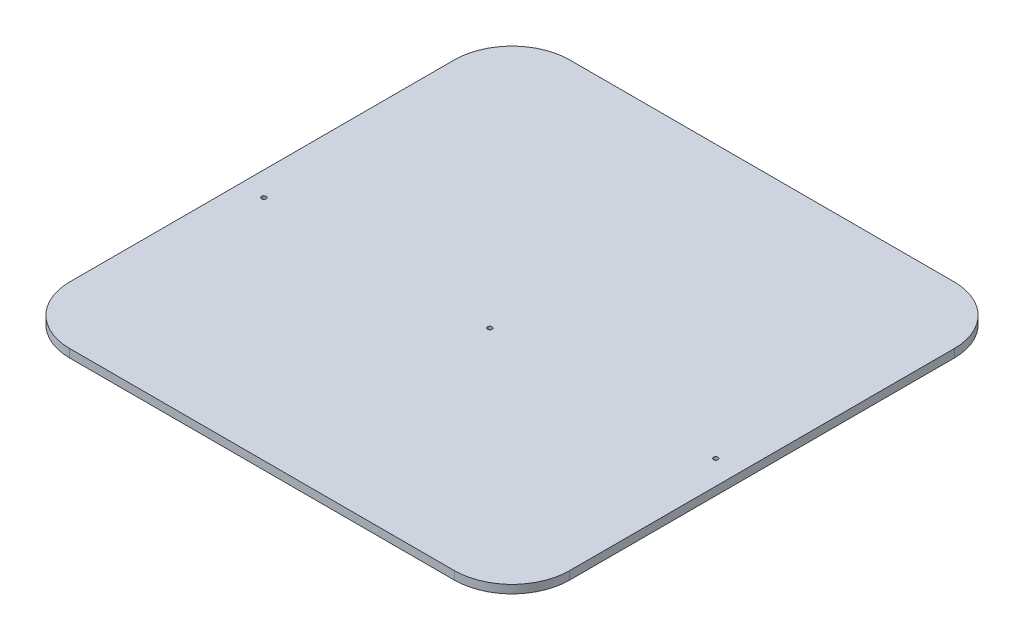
ISO-10303-21;
HEADER;
FILE_DESCRIPTION(('STEP AP214'),'2;1');
FILE_NAME('part.step','',(''),(''),'','','');
FILE_SCHEMA(('AUTOMOTIVE_DESIGN { 1 0 10303 214 1 1 1 1 }'));
ENDSEC;
DATA;
#1=APPLICATION_CONTEXT('core data for automotive mechanical design processes');
#2=APPLICATION_PROTOCOL_DEFINITION('international standard','automotive_design',2000,#1);
#3=PRODUCT_CONTEXT('',#1,'mechanical');
#4=PRODUCT('Part','Part','',(#3));
#5=PRODUCT_RELATED_PRODUCT_CATEGORY('part','',(#4));
#6=PRODUCT_DEFINITION_FORMATION('','',#4);
#7=PRODUCT_DEFINITION_CONTEXT('part definition',#1,'design');
#8=PRODUCT_DEFINITION('design','',#6,#7);
#9=PRODUCT_DEFINITION_SHAPE('','',#8);
#10=(LENGTH_UNIT() NAMED_UNIT(*) SI_UNIT(.MILLI.,.METRE.));
#11=(NAMED_UNIT(*) PLANE_ANGLE_UNIT() SI_UNIT($,.RADIAN.));
#12=(NAMED_UNIT(*) SI_UNIT($,.STERADIAN.) SOLID_ANGLE_UNIT());
#13=UNCERTAINTY_MEASURE_WITH_UNIT(LENGTH_MEASURE(1.E-05),#10,'distance_accuracy_value','');
#14=(GEOMETRIC_REPRESENTATION_CONTEXT(3) GLOBAL_UNCERTAINTY_ASSIGNED_CONTEXT((#13)) GLOBAL_UNIT_ASSIGNED_CONTEXT((#10,
#11,#12)) REPRESENTATION_CONTEXT('',''));
#15=CARTESIAN_POINT('',(0.,0.,0.));
#16=DIRECTION('',(0.,0.,1.));
#17=DIRECTION('',(1.,0.,0.));
#18=AXIS2_PLACEMENT_3D('',#15,#16,#17);
#19=CARTESIAN_POINT('',(203.2,8.73125000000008,-203.2));
#20=DIRECTION('',(0.,-1.,0.));
#21=DIRECTION('',(0.,0.,-1.));
#22=AXIS2_PLACEMENT_3D('',#19,#20,#21);
#23=CYLINDRICAL_SURFACE('',#22,60.96);
#24=CARTESIAN_POINT('',(203.2,0.,-203.2));
#25=DIRECTION('',(0.,1.,0.));
#26=DIRECTION('',(0.,0.,-1.));
#27=AXIS2_PLACEMENT_3D('',#24,#25,#26);
#28=CIRCLE('',#27,60.96);
#29=CARTESIAN_POINT('',(264.16,0.,-203.2));
#30=VERTEX_POINT('',#29);
#31=CARTESIAN_POINT('',(203.2,0.,-264.16));
#32=VERTEX_POINT('',#31);
#33=EDGE_CURVE('E131',#30,#32,#28,.T.);
#34=ORIENTED_EDGE('',*,*,#33,.T.);
#35=DIRECTION('',(0.,-1.,0.));
#36=VECTOR('',#35,1.);
#37=CARTESIAN_POINT('',(203.2,8.73124999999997,-264.16));
#38=LINE('',#37,#36);
#39=CARTESIAN_POINT('',(203.2,8.73124999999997,-264.16));
#40=VERTEX_POINT('',#39);
#41=EDGE_CURVE('E11',#40,#32,#38,.T.);
#42=ORIENTED_EDGE('',*,*,#41,.F.);
#43=CARTESIAN_POINT('',(203.2,8.73125000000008,-203.2));
#44=DIRECTION('',(0.,1.,0.));
#45=DIRECTION('',(0.,0.,-1.));
#46=AXIS2_PLACEMENT_3D('',#43,#44,#45);
#47=CIRCLE('',#46,60.96);
#48=CARTESIAN_POINT('',(264.16,8.73125000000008,-203.2));
#49=VERTEX_POINT('',#48);
#50=EDGE_CURVE('E146',#49,#40,#47,.T.);
#51=ORIENTED_EDGE('',*,*,#50,.F.);
#52=DIRECTION('',(0.,-1.,0.));
#53=VECTOR('',#52,1.);
#54=CARTESIAN_POINT('',(264.16,8.73125000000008,-203.2));
#55=LINE('',#54,#53);
#56=EDGE_CURVE('E127',#49,#30,#55,.T.);
#57=ORIENTED_EDGE('',*,*,#56,.T.);
#58=EDGE_LOOP('',(#34,#42,#51,#57));
#59=FACE_BOUND('',#58,.T.);
#60=ADVANCED_FACE('F35',(#59),#23,.T.);
#61=CARTESIAN_POINT('',(-203.2,8.73124999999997,-264.16));
#62=DIRECTION('',(0.,0.,1.));
#63=DIRECTION('',(1.,0.,0.));
#64=AXIS2_PLACEMENT_3D('',#61,#62,#63);
#65=PLANE('',#64);
#66=DIRECTION('',(-1.,0.,0.));
#67=VECTOR('',#66,1.);
#68=CARTESIAN_POINT('',(-203.2,0.,-264.16));
#69=LINE('',#68,#67);
#70=CARTESIAN_POINT('',(-203.2,0.,-264.16));
#71=VERTEX_POINT('',#70);
#72=EDGE_CURVE('E134',#32,#71,#69,.T.);
#73=ORIENTED_EDGE('',*,*,#72,.T.);
#74=DIRECTION('',(0.,-1.,0.));
#75=VECTOR('',#74,1.);
#76=CARTESIAN_POINT('',(-203.2,8.73124999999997,-264.16));
#77=LINE('',#76,#75);
#78=CARTESIAN_POINT('',(-203.2,8.73124999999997,-264.16));
#79=VERTEX_POINT('',#78);
#80=EDGE_CURVE('E43',#79,#71,#77,.T.);
#81=ORIENTED_EDGE('',*,*,#80,.F.);
#82=DIRECTION('',(-1.,0.,0.));
#83=VECTOR('',#82,1.);
#84=CARTESIAN_POINT('',(-203.2,8.73124999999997,-264.16));
#85=LINE('',#84,#83);
#86=EDGE_CURVE('E94',#40,#79,#85,.T.);
#87=ORIENTED_EDGE('',*,*,#86,.F.);
#88=ORIENTED_EDGE('',*,*,#41,.T.);
#89=EDGE_LOOP('',(#73,#81,#87,#88));
#90=FACE_BOUND('',#89,.T.);
#91=ADVANCED_FACE('F227',(#90),#65,.F.);
#92=CARTESIAN_POINT('',(-203.2,8.73125000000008,-203.2));
#93=DIRECTION('',(0.,-1.,0.));
#94=DIRECTION('',(0.,0.,-1.));
#95=AXIS2_PLACEMENT_3D('',#92,#93,#94);
#96=CYLINDRICAL_SURFACE('',#95,60.96);
#97=CARTESIAN_POINT('',(-203.2,0.,-203.2));
#98=DIRECTION('',(0.,1.,0.));
#99=DIRECTION('',(0.,0.,1.));
#100=AXIS2_PLACEMENT_3D('',#97,#98,#99);
#101=CIRCLE('',#100,60.96);
#102=CARTESIAN_POINT('',(-264.16,0.,-203.2));
#103=VERTEX_POINT('',#102);
#104=EDGE_CURVE('E137',#71,#103,#101,.T.);
#105=ORIENTED_EDGE('',*,*,#104,.T.);
#106=DIRECTION('',(0.,-1.,0.));
#107=VECTOR('',#106,1.);
#108=CARTESIAN_POINT('',(-264.16,8.73124999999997,-203.2));
#109=LINE('',#108,#107);
#110=CARTESIAN_POINT('',(-264.16,8.73124999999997,-203.2));
#111=VERTEX_POINT('',#110);
#112=EDGE_CURVE('E153',#111,#103,#109,.T.);
#113=ORIENTED_EDGE('',*,*,#112,.F.);
#114=CARTESIAN_POINT('',(-203.2,8.73125000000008,-203.2));
#115=DIRECTION('',(0.,1.,0.));
#116=DIRECTION('',(0.,0.,1.));
#117=AXIS2_PLACEMENT_3D('',#114,#115,#116);
#118=CIRCLE('',#117,60.96);
#119=EDGE_CURVE('E161',#79,#111,#118,.T.);
#120=ORIENTED_EDGE('',*,*,#119,.F.);
#121=ORIENTED_EDGE('',*,*,#80,.T.);
#122=EDGE_LOOP('',(#105,#113,#120,#121));
#123=FACE_BOUND('',#122,.T.);
#124=ADVANCED_FACE('F159',(#123),#96,.T.);
#125=CARTESIAN_POINT('',(-264.16,8.73124999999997,-203.2));
#126=DIRECTION('',(1.,0.,0.));
#127=DIRECTION('',(0.,0.,-1.));
#128=AXIS2_PLACEMENT_3D('',#125,#126,#127);
#129=PLANE('',#128);
#130=DIRECTION('',(0.,0.,1.));
#131=VECTOR('',#130,1.);
#132=CARTESIAN_POINT('',(-264.16,0.,-203.2));
#133=LINE('',#132,#131);
#134=CARTESIAN_POINT('',(-264.16,0.,203.2));
#135=VERTEX_POINT('',#134);
#136=EDGE_CURVE('E139',#103,#135,#133,.T.);
#137=ORIENTED_EDGE('',*,*,#136,.T.);
#138=DIRECTION('',(0.,-1.,0.));
#139=VECTOR('',#138,1.);
#140=CARTESIAN_POINT('',(-264.16,8.73124999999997,203.2));
#141=LINE('',#140,#139);
#142=CARTESIAN_POINT('',(-264.16,8.73124999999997,203.2));
#143=VERTEX_POINT('',#142);
#144=EDGE_CURVE('E150',#143,#135,#141,.T.);
#145=ORIENTED_EDGE('',*,*,#144,.F.);
#146=DIRECTION('',(0.,0.,1.));
#147=VECTOR('',#146,1.);
#148=CARTESIAN_POINT('',(-264.16,8.73124999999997,-203.2));
#149=LINE('',#148,#147);
#150=EDGE_CURVE('E173',#111,#143,#149,.T.);
#151=ORIENTED_EDGE('',*,*,#150,.F.);
#152=ORIENTED_EDGE('',*,*,#112,.T.);
#153=EDGE_LOOP('',(#137,#145,#151,#152));
#154=FACE_BOUND('',#153,.T.);
#155=ADVANCED_FACE('F169',(#154),#129,.F.);
#156=CARTESIAN_POINT('',(-203.2,8.73124999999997,203.2));
#157=DIRECTION('',(0.,-1.,0.));
#158=DIRECTION('',(0.,0.,-1.));
#159=AXIS2_PLACEMENT_3D('',#156,#157,#158);
#160=CYLINDRICAL_SURFACE('',#159,60.96);
#161=CARTESIAN_POINT('',(-203.2,0.,203.2));
#162=DIRECTION('',(0.,1.,0.));
#163=DIRECTION('',(0.,0.,1.));
#164=AXIS2_PLACEMENT_3D('',#161,#162,#163);
#165=CIRCLE('',#164,60.96);
#166=CARTESIAN_POINT('',(-203.2,0.,264.16));
#167=VERTEX_POINT('',#166);
#168=EDGE_CURVE('E141',#135,#167,#165,.T.);
#169=ORIENTED_EDGE('',*,*,#168,.T.);
#170=DIRECTION('',(0.,-1.,0.));
#171=VECTOR('',#170,1.);
#172=CARTESIAN_POINT('',(-203.2,8.73124999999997,264.16));
#173=LINE('',#172,#171);
#174=CARTESIAN_POINT('',(-203.2,8.73124999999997,264.16));
#175=VERTEX_POINT('',#174);
#176=EDGE_CURVE('E122',#175,#167,#173,.T.);
#177=ORIENTED_EDGE('',*,*,#176,.F.);
#178=CARTESIAN_POINT('',(-203.2,8.73124999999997,203.2));
#179=DIRECTION('',(0.,1.,0.));
#180=DIRECTION('',(0.,0.,1.));
#181=AXIS2_PLACEMENT_3D('',#178,#179,#180);
#182=CIRCLE('',#181,60.96);
#183=EDGE_CURVE('E113',#143,#175,#182,.T.);
#184=ORIENTED_EDGE('',*,*,#183,.F.);
#185=ORIENTED_EDGE('',*,*,#144,.T.);
#186=EDGE_LOOP('',(#169,#177,#184,#185));
#187=FACE_BOUND('',#186,.T.);
#188=ADVANCED_FACE('F172',(#187),#160,.T.);
#189=CARTESIAN_POINT('',(-203.2,8.73124999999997,264.16));
#190=DIRECTION('',(0.,0.,-1.));
#191=DIRECTION('',(-1.,0.,0.));
#192=AXIS2_PLACEMENT_3D('',#189,#190,#191);
#193=PLANE('',#192);
#194=DIRECTION('',(1.,0.,0.));
#195=VECTOR('',#194,1.);
#196=CARTESIAN_POINT('',(-203.2,0.,264.16));
#197=LINE('',#196,#195);
#198=CARTESIAN_POINT('',(203.2,0.,264.16));
#199=VERTEX_POINT('',#198);
#200=EDGE_CURVE('E121',#167,#199,#197,.T.);
#201=ORIENTED_EDGE('',*,*,#200,.T.);
#202=DIRECTION('',(0.,-1.,0.));
#203=VECTOR('',#202,1.);
#204=CARTESIAN_POINT('',(203.2,8.73124999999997,264.16));
#205=LINE('',#204,#203);
#206=CARTESIAN_POINT('',(203.2,8.73124999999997,264.16));
#207=VERTEX_POINT('',#206);
#208=EDGE_CURVE('E118',#207,#199,#205,.T.);
#209=ORIENTED_EDGE('',*,*,#208,.F.);
#210=DIRECTION('',(1.,0.,0.));
#211=VECTOR('',#210,1.);
#212=CARTESIAN_POINT('',(-203.2,8.73124999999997,264.16));
#213=LINE('',#212,#211);
#214=EDGE_CURVE('E107',#175,#207,#213,.T.);
#215=ORIENTED_EDGE('',*,*,#214,.F.);
#216=ORIENTED_EDGE('',*,*,#176,.T.);
#217=EDGE_LOOP('',(#201,#209,#215,#216));
#218=FACE_BOUND('',#217,.T.);
#219=ADVANCED_FACE('F119',(#218),#193,.F.);
#220=CARTESIAN_POINT('',(203.2,8.73124999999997,203.2));
#221=DIRECTION('',(0.,-1.,0.));
#222=DIRECTION('',(0.,0.,-1.));
#223=AXIS2_PLACEMENT_3D('',#220,#221,#222);
#224=CYLINDRICAL_SURFACE('',#223,60.96);
#225=CARTESIAN_POINT('',(203.2,0.,203.2));
#226=DIRECTION('',(0.,1.,0.));
#227=DIRECTION('',(0.,0.,1.));
#228=AXIS2_PLACEMENT_3D('',#225,#226,#227);
#229=CIRCLE('',#228,60.96);
#230=CARTESIAN_POINT('',(264.16,0.,203.2));
#231=VERTEX_POINT('',#230);
#232=EDGE_CURVE('E80',#199,#231,#229,.T.);
#233=ORIENTED_EDGE('',*,*,#232,.T.);
#234=DIRECTION('',(0.,-1.,0.));
#235=VECTOR('',#234,1.);
#236=CARTESIAN_POINT('',(264.16,8.73124999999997,203.2));
#237=LINE('',#236,#235);
#238=CARTESIAN_POINT('',(264.16,8.73124999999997,203.2));
#239=VERTEX_POINT('',#238);
#240=EDGE_CURVE('E123',#239,#231,#237,.T.);
#241=ORIENTED_EDGE('',*,*,#240,.F.);
#242=CARTESIAN_POINT('',(203.2,8.73124999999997,203.2));
#243=DIRECTION('',(0.,1.,0.));
#244=DIRECTION('',(0.,0.,1.));
#245=AXIS2_PLACEMENT_3D('',#242,#243,#244);
#246=CIRCLE('',#245,60.96);
#247=EDGE_CURVE('E111',#207,#239,#246,.T.);
#248=ORIENTED_EDGE('',*,*,#247,.F.);
#249=ORIENTED_EDGE('',*,*,#208,.T.);
#250=EDGE_LOOP('',(#233,#241,#248,#249));
#251=FACE_BOUND('',#250,.T.);
#252=ADVANCED_FACE('F125',(#251),#224,.T.);
#253=CARTESIAN_POINT('',(264.16,8.73125000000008,-203.2));
#254=DIRECTION('',(-1.,0.,0.));
#255=DIRECTION('',(0.,0.,1.));
#256=AXIS2_PLACEMENT_3D('',#253,#254,#255);
#257=PLANE('',#256);
#258=DIRECTION('',(0.,0.,-1.));
#259=VECTOR('',#258,1.);
#260=CARTESIAN_POINT('',(264.16,0.,-203.2));
#261=LINE('',#260,#259);
#262=EDGE_CURVE('E86',#231,#30,#261,.T.);
#263=ORIENTED_EDGE('',*,*,#262,.T.);
#264=ORIENTED_EDGE('',*,*,#56,.F.);
#265=DIRECTION('',(0.,0.,-1.));
#266=VECTOR('',#265,1.);
#267=CARTESIAN_POINT('',(264.16,8.73125000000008,-203.2));
#268=LINE('',#267,#266);
#269=EDGE_CURVE('E51',#239,#49,#268,.T.);
#270=ORIENTED_EDGE('',*,*,#269,.F.);
#271=ORIENTED_EDGE('',*,*,#240,.T.);
#272=EDGE_LOOP('',(#263,#264,#270,#271));
#273=FACE_BOUND('',#272,.T.);
#274=ADVANCED_FACE('F208',(#273),#257,.F.);
#275=CARTESIAN_POINT('',(203.2,8.73125000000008,-203.2));
#276=DIRECTION('',(0.,-1.,0.));
#277=DIRECTION('',(0.,0.,-1.));
#278=AXIS2_PLACEMENT_3D('',#275,#276,#277);
#279=PLANE('',#278);
#280=CARTESIAN_POINT('',(238.76,8.73124999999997,23.4156249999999));
#281=DIRECTION('',(0.,1.,0.));
#282=DIRECTION('',(0.,0.,1.));
#283=AXIS2_PLACEMENT_3D('',#280,#281,#282);
#284=CIRCLE('',#283,2.38125000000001);
#285=CARTESIAN_POINT('',(238.76,8.73124999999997,25.7968749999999));
#286=VERTEX_POINT('',#285);
#287=EDGE_CURVE('E191',#286,#286,#284,.T.);
#288=ORIENTED_EDGE('',*,*,#287,.F.);
#289=EDGE_LOOP('',(#288));
#290=FACE_BOUND('',#289,.T.);
#291=CARTESIAN_POINT('',(0.,8.73124999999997,23.415625));
#292=DIRECTION('',(0.,1.,0.));
#293=DIRECTION('',(0.,0.,1.));
#294=AXIS2_PLACEMENT_3D('',#291,#292,#293);
#295=CIRCLE('',#294,2.38125);
#296=CARTESIAN_POINT('',(0.,8.73124999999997,25.796875));
#297=VERTEX_POINT('',#296);
#298=EDGE_CURVE('E185',#297,#297,#295,.T.);
#299=ORIENTED_EDGE('',*,*,#298,.F.);
#300=EDGE_LOOP('',(#299));
#301=FACE_BOUND('',#300,.T.);
#302=CARTESIAN_POINT('',(-238.76,8.73124999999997,23.4156249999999));
#303=DIRECTION('',(0.,1.,0.));
#304=DIRECTION('',(0.,0.,1.));
#305=AXIS2_PLACEMENT_3D('',#302,#303,#304);
#306=CIRCLE('',#305,2.38125000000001);
#307=CARTESIAN_POINT('',(-238.76,8.73124999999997,25.7968749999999));
#308=VERTEX_POINT('',#307);
#309=EDGE_CURVE('E179',#308,#308,#306,.T.);
#310=ORIENTED_EDGE('',*,*,#309,.F.);
#311=EDGE_LOOP('',(#310));
#312=FACE_BOUND('',#311,.T.);
#313=ORIENTED_EDGE('',*,*,#50,.T.);
#314=ORIENTED_EDGE('',*,*,#86,.T.);
#315=ORIENTED_EDGE('',*,*,#119,.T.);
#316=ORIENTED_EDGE('',*,*,#150,.T.);
#317=ORIENTED_EDGE('',*,*,#183,.T.);
#318=ORIENTED_EDGE('',*,*,#214,.T.);
#319=ORIENTED_EDGE('',*,*,#247,.T.);
#320=ORIENTED_EDGE('',*,*,#269,.T.);
#321=EDGE_LOOP('',(#313,#314,#315,#316,#317,#318,#319,#320));
#322=FACE_BOUND('',#321,.T.);
#323=ADVANCED_FACE('F109',(#290,#301,#312,#322),#279,.F.);
#324=CARTESIAN_POINT('',(203.2,0.,-203.2));
#325=DIRECTION('',(0.,-1.,0.));
#326=DIRECTION('',(0.,0.,-1.));
#327=AXIS2_PLACEMENT_3D('',#324,#325,#326);
#328=PLANE('',#327);
#329=CARTESIAN_POINT('',(238.76,0.,23.4156249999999));
#330=DIRECTION('',(0.,1.,0.));
#331=DIRECTION('',(0.,0.,1.));
#332=AXIS2_PLACEMENT_3D('',#329,#330,#331);
#333=CIRCLE('',#332,2.38125000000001);
#334=CARTESIAN_POINT('',(238.76,0.,25.7968749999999));
#335=VERTEX_POINT('',#334);
#336=EDGE_CURVE('E188',#335,#335,#333,.T.);
#337=ORIENTED_EDGE('',*,*,#336,.T.);
#338=EDGE_LOOP('',(#337));
#339=FACE_BOUND('',#338,.T.);
#340=CARTESIAN_POINT('',(0.,0.,23.415625));
#341=DIRECTION('',(0.,1.,0.));
#342=DIRECTION('',(0.,0.,1.));
#343=AXIS2_PLACEMENT_3D('',#340,#341,#342);
#344=CIRCLE('',#343,2.38125);
#345=CARTESIAN_POINT('',(0.,0.,25.796875));
#346=VERTEX_POINT('',#345);
#347=EDGE_CURVE('E182',#346,#346,#344,.T.);
#348=ORIENTED_EDGE('',*,*,#347,.T.);
#349=EDGE_LOOP('',(#348));
#350=FACE_BOUND('',#349,.T.);
#351=CARTESIAN_POINT('',(-238.76,0.,23.4156249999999));
#352=DIRECTION('',(0.,1.,0.));
#353=DIRECTION('',(0.,0.,1.));
#354=AXIS2_PLACEMENT_3D('',#351,#352,#353);
#355=CIRCLE('',#354,2.38125000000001);
#356=CARTESIAN_POINT('',(-238.76,0.,25.7968749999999));
#357=VERTEX_POINT('',#356);
#358=EDGE_CURVE('E135',#357,#357,#355,.T.);
#359=ORIENTED_EDGE('',*,*,#358,.T.);
#360=EDGE_LOOP('',(#359));
#361=FACE_BOUND('',#360,.T.);
#362=ORIENTED_EDGE('',*,*,#33,.F.);
#363=ORIENTED_EDGE('',*,*,#262,.F.);
#364=ORIENTED_EDGE('',*,*,#232,.F.);
#365=ORIENTED_EDGE('',*,*,#200,.F.);
#366=ORIENTED_EDGE('',*,*,#168,.F.);
#367=ORIENTED_EDGE('',*,*,#136,.F.);
#368=ORIENTED_EDGE('',*,*,#104,.F.);
#369=ORIENTED_EDGE('',*,*,#72,.F.);
#370=EDGE_LOOP('',(#362,#363,#364,#365,#366,#367,#368,#369));
#371=FACE_BOUND('',#370,.T.);
#372=ADVANCED_FACE('F165',(#339,#350,#361,#371),#328,.T.);
#373=CARTESIAN_POINT('',(-238.76,0.,23.4156249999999));
#374=DIRECTION('',(0.,1.,0.));
#375=DIRECTION('',(0.,0.,1.));
#376=AXIS2_PLACEMENT_3D('',#373,#374,#375);
#377=CYLINDRICAL_SURFACE('',#376,2.38125000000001);
#378=ORIENTED_EDGE('',*,*,#358,.F.);
#379=EDGE_LOOP('',(#378));
#380=FACE_BOUND('',#379,.T.);
#381=ORIENTED_EDGE('',*,*,#309,.T.);
#382=EDGE_LOOP('',(#381));
#383=FACE_BOUND('',#382,.T.);
#384=ADVANCED_FACE('F214',(#380,#383),#377,.F.);
#385=CARTESIAN_POINT('',(0.,0.,23.415625));
#386=DIRECTION('',(0.,1.,0.));
#387=DIRECTION('',(0.,0.,1.));
#388=AXIS2_PLACEMENT_3D('',#385,#386,#387);
#389=CYLINDRICAL_SURFACE('',#388,2.38125);
#390=ORIENTED_EDGE('',*,*,#347,.F.);
#391=EDGE_LOOP('',(#390));
#392=FACE_BOUND('',#391,.T.);
#393=ORIENTED_EDGE('',*,*,#298,.T.);
#394=EDGE_LOOP('',(#393));
#395=FACE_BOUND('',#394,.T.);
#396=ADVANCED_FACE('F202',(#392,#395),#389,.F.);
#397=CARTESIAN_POINT('',(238.76,0.,23.4156249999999));
#398=DIRECTION('',(0.,1.,0.));
#399=DIRECTION('',(0.,0.,1.));
#400=AXIS2_PLACEMENT_3D('',#397,#398,#399);
#401=CYLINDRICAL_SURFACE('',#400,2.38125000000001);
#402=ORIENTED_EDGE('',*,*,#336,.F.);
#403=EDGE_LOOP('',(#402));
#404=FACE_BOUND('',#403,.T.);
#405=ORIENTED_EDGE('',*,*,#287,.T.);
#406=EDGE_LOOP('',(#405));
#407=FACE_BOUND('',#406,.T.);
#408=ADVANCED_FACE('F199',(#404,#407),#401,.F.);
#409=CLOSED_SHELL('',(#60,#91,#124,#155,#188,#219,#252,#274,#323,#372,#384,#396,#408));
#410=MANIFOLD_SOLID_BREP('B2',#409);
#411=ADVANCED_BREP_SHAPE_REPRESENTATION('',(#18,#410),#14);
#412=SHAPE_DEFINITION_REPRESENTATION(#9,#411);
ENDSEC;
END-ISO-10303-21;
